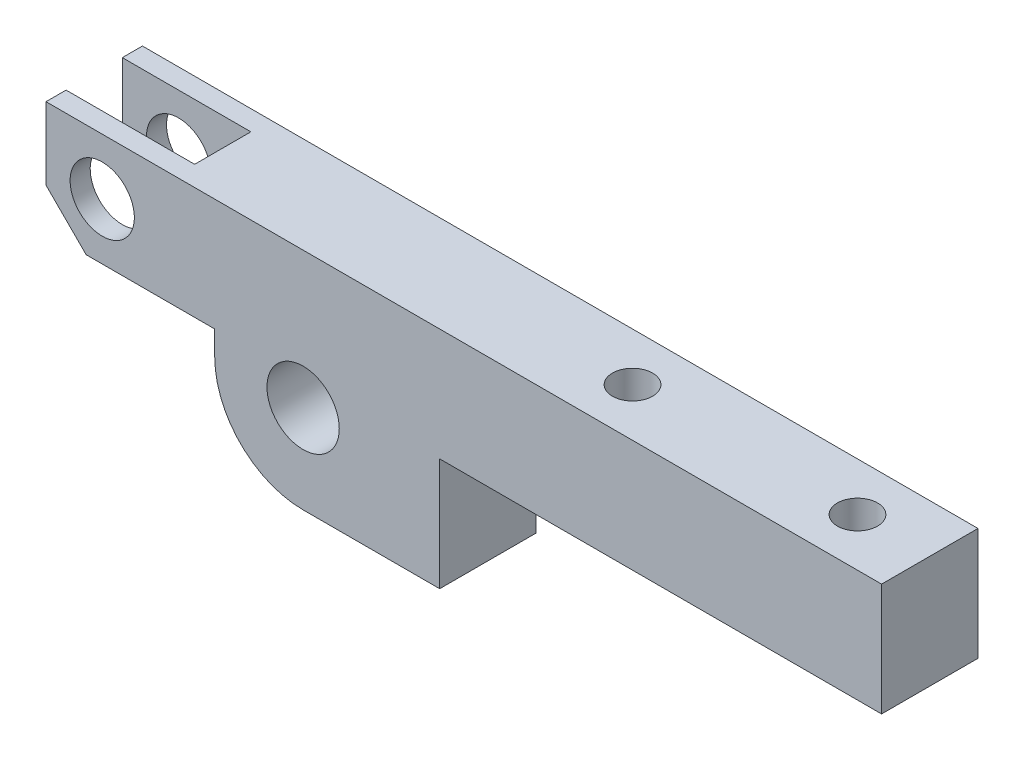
ISO-10303-21;
HEADER;
FILE_DESCRIPTION(('STEP AP214'),'2;1');
FILE_NAME('part.step','',(''),(''),'','','');
FILE_SCHEMA(('AUTOMOTIVE_DESIGN { 1 0 10303 214 1 1 1 1 }'));
ENDSEC;
DATA;
#1=APPLICATION_CONTEXT('core data for automotive mechanical design processes');
#2=APPLICATION_PROTOCOL_DEFINITION('international standard','automotive_design',2000,#1);
#3=PRODUCT_CONTEXT('',#1,'mechanical');
#4=PRODUCT('Part','Part','',(#3));
#5=PRODUCT_RELATED_PRODUCT_CATEGORY('part','',(#4));
#6=PRODUCT_DEFINITION_FORMATION('','',#4);
#7=PRODUCT_DEFINITION_CONTEXT('part definition',#1,'design');
#8=PRODUCT_DEFINITION('design','',#6,#7);
#9=PRODUCT_DEFINITION_SHAPE('','',#8);
#10=(LENGTH_UNIT() NAMED_UNIT(*) SI_UNIT(.MILLI.,.METRE.));
#11=(NAMED_UNIT(*) PLANE_ANGLE_UNIT() SI_UNIT($,.RADIAN.));
#12=(NAMED_UNIT(*) SI_UNIT($,.STERADIAN.) SOLID_ANGLE_UNIT());
#13=UNCERTAINTY_MEASURE_WITH_UNIT(LENGTH_MEASURE(1.E-05),#10,'distance_accuracy_value','');
#14=(GEOMETRIC_REPRESENTATION_CONTEXT(3) GLOBAL_UNCERTAINTY_ASSIGNED_CONTEXT((#13)) GLOBAL_UNIT_ASSIGNED_CONTEXT((#10,
#11,#12)) REPRESENTATION_CONTEXT('',''));
#15=CARTESIAN_POINT('',(0.,0.,0.));
#16=DIRECTION('',(0.,0.,1.));
#17=DIRECTION('',(1.,0.,0.));
#18=AXIS2_PLACEMENT_3D('',#15,#16,#17);
#19=CARTESIAN_POINT('',(-80.0000000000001,40.0000000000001,12.));
#20=DIRECTION('',(1.,0.,0.));
#21=DIRECTION('',(0.,0.,-1.));
#22=AXIS2_PLACEMENT_3D('',#19,#20,#21);
#23=PLANE('',#22);
#24=DIRECTION('',(0.,-1.,0.));
#25=VECTOR('',#24,1.);
#26=CARTESIAN_POINT('',(-80.0000000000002,40.0000000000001,0.));
#27=LINE('',#26,#25);
#28=CARTESIAN_POINT('',(-80.0000000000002,40.0000000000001,0.));
#29=VERTEX_POINT('',#28);
#30=CARTESIAN_POINT('',(-80.0000000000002,31.0000000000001,0.));
#31=VERTEX_POINT('',#30);
#32=EDGE_CURVE('E239',#29,#31,#27,.T.);
#33=ORIENTED_EDGE('',*,*,#32,.T.);
#34=DIRECTION('',(0.,0.,1.));
#35=VECTOR('',#34,1.);
#36=CARTESIAN_POINT('',(-80.0000000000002,31.0000000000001,12.));
#37=LINE('',#36,#35);
#38=CARTESIAN_POINT('',(-80.0000000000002,31.0000000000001,2.49999999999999));
#39=VERTEX_POINT('',#38);
#40=EDGE_CURVE('E166',#31,#39,#37,.T.);
#41=ORIENTED_EDGE('',*,*,#40,.T.);
#42=DIRECTION('',(0.,-1.,0.));
#43=VECTOR('',#42,1.);
#44=CARTESIAN_POINT('',(-80.0000000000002,40.0000000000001,2.49999999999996));
#45=LINE('',#44,#43);
#46=CARTESIAN_POINT('',(-80.0000000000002,40.0000000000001,2.49999999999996));
#47=VERTEX_POINT('',#46);
#48=EDGE_CURVE('E137',#47,#39,#45,.T.);
#49=ORIENTED_EDGE('',*,*,#48,.F.);
#50=DIRECTION('',(0.,0.,-1.));
#51=VECTOR('',#50,1.);
#52=CARTESIAN_POINT('',(-80.0000000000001,40.0000000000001,12.));
#53=LINE('',#52,#51);
#54=EDGE_CURVE('E153',#47,#29,#53,.T.);
#55=ORIENTED_EDGE('',*,*,#54,.T.);
#56=EDGE_LOOP('',(#33,#41,#49,#55));
#57=FACE_BOUND('',#56,.T.);
#58=ADVANCED_FACE('F24',(#57),#23,.F.);
#59=CARTESIAN_POINT('',(-48.,23.0000000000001,12.));
#60=DIRECTION('',(0.,0.,1.));
#61=DIRECTION('',(1.,0.,0.));
#62=AXIS2_PLACEMENT_3D('',#59,#60,#61);
#63=PLANE('',#62);
#64=CARTESIAN_POINT('',(-73.0000000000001,33.,12.));
#65=DIRECTION('',(0.,0.,1.));
#66=DIRECTION('',(1.,0.,0.));
#67=AXIS2_PLACEMENT_3D('',#64,#65,#66);
#68=CIRCLE('',#67,4.00000000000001);
#69=CARTESIAN_POINT('',(-69.0000000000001,33.,12.));
#70=VERTEX_POINT('',#69);
#71=EDGE_CURVE('E178',#70,#70,#68,.T.);
#72=ORIENTED_EDGE('',*,*,#71,.F.);
#73=EDGE_LOOP('',(#72));
#74=FACE_BOUND('',#73,.T.);
#75=DIRECTION('',(0.,-1.,0.));
#76=VECTOR('',#75,1.);
#77=CARTESIAN_POINT('',(-80.0000000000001,40.0000000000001,12.));
#78=LINE('',#77,#76);
#79=CARTESIAN_POINT('',(-80.0000000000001,40.0000000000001,12.));
#80=VERTEX_POINT('',#79);
#81=CARTESIAN_POINT('',(-80.0000000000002,31.0000000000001,12.));
#82=VERTEX_POINT('',#81);
#83=EDGE_CURVE('E151',#80,#82,#78,.T.);
#84=ORIENTED_EDGE('',*,*,#83,.T.);
#85=DIRECTION('',(-0.707106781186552,0.707106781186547,0.));
#86=VECTOR('',#85,1.);
#87=CARTESIAN_POINT('',(-59.9999999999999,11.0000000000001,12.));
#88=LINE('',#87,#86);
#89=CARTESIAN_POINT('',(-75.,26.0000000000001,12.));
#90=VERTEX_POINT('',#89);
#91=EDGE_CURVE('E11',#82,#90,#88,.F.);
#92=ORIENTED_EDGE('',*,*,#91,.T.);
#93=DIRECTION('',(1.,0.,0.));
#94=VECTOR('',#93,1.);
#95=CARTESIAN_POINT('',(-80.0000000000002,26.0000000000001,12.));
#96=LINE('',#95,#94);
#97=CARTESIAN_POINT('',(-59.0000000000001,26.0000000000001,12.));
#98=VERTEX_POINT('',#97);
#99=EDGE_CURVE('E262',#90,#98,#96,.T.);
#100=ORIENTED_EDGE('',*,*,#99,.T.);
#101=DIRECTION('',(0.,1.,0.));
#102=VECTOR('',#101,1.);
#103=CARTESIAN_POINT('',(-59.0000000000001,23.0000000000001,12.));
#104=LINE('',#103,#102);
#105=CARTESIAN_POINT('',(-59.0000000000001,23.0000000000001,12.));
#106=VERTEX_POINT('',#105);
#107=EDGE_CURVE('E259',#106,#98,#104,.T.);
#108=ORIENTED_EDGE('',*,*,#107,.F.);
#109=CARTESIAN_POINT('',(-48.,23.0000000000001,12.));
#110=DIRECTION('',(0.,0.,1.));
#111=DIRECTION('',(1.,0.,0.));
#112=AXIS2_PLACEMENT_3D('',#109,#110,#111);
#113=CIRCLE('',#112,11.);
#114=CARTESIAN_POINT('',(-48.0000000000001,12.,12.));
#115=VERTEX_POINT('',#114);
#116=EDGE_CURVE('E256',#106,#115,#113,.T.);
#117=ORIENTED_EDGE('',*,*,#116,.T.);
#118=DIRECTION('',(1.,0.,0.));
#119=VECTOR('',#118,1.);
#120=CARTESIAN_POINT('',(-48.0000000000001,12.,12.));
#121=LINE('',#120,#119);
#122=CARTESIAN_POINT('',(-31.,12.,12.));
#123=VERTEX_POINT('',#122);
#124=EDGE_CURVE('E253',#115,#123,#121,.T.);
#125=ORIENTED_EDGE('',*,*,#124,.T.);
#126=DIRECTION('',(0.,-1.,0.));
#127=VECTOR('',#126,1.);
#128=CARTESIAN_POINT('',(-31.0000000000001,26.0000000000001,12.));
#129=LINE('',#128,#127);
#130=CARTESIAN_POINT('',(-31.0000000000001,26.0000000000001,12.));
#131=VERTEX_POINT('',#130);
#132=EDGE_CURVE('E250',#131,#123,#129,.T.);
#133=ORIENTED_EDGE('',*,*,#132,.F.);
#134=DIRECTION('',(-1.,0.,0.));
#135=VECTOR('',#134,1.);
#136=CARTESIAN_POINT('',(24.0000000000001,26.0000000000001,12.));
#137=LINE('',#136,#135);
#138=CARTESIAN_POINT('',(24.0000000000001,26.0000000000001,12.));
#139=VERTEX_POINT('',#138);
#140=EDGE_CURVE('E247',#139,#131,#137,.T.);
#141=ORIENTED_EDGE('',*,*,#140,.F.);
#142=DIRECTION('',(0.,-1.,0.));
#143=VECTOR('',#142,1.);
#144=CARTESIAN_POINT('',(24.0000000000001,40.0000000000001,12.));
#145=LINE('',#144,#143);
#146=CARTESIAN_POINT('',(24.0000000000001,40.0000000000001,12.));
#147=VERTEX_POINT('',#146);
#148=EDGE_CURVE('E244',#147,#139,#145,.T.);
#149=ORIENTED_EDGE('',*,*,#148,.F.);
#150=DIRECTION('',(1.,0.,0.));
#151=VECTOR('',#150,1.);
#152=CARTESIAN_POINT('',(-80.0000000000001,40.0000000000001,12.));
#153=LINE('',#152,#151);
#154=EDGE_CURVE('E242',#80,#147,#153,.T.);
#155=ORIENTED_EDGE('',*,*,#154,.F.);
#156=EDGE_LOOP('',(#84,#92,#100,#108,#117,#125,#133,#141,#149,#155));
#157=FACE_BOUND('',#156,.T.);
#158=CARTESIAN_POINT('',(-48.,23.0000000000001,12.));
#159=DIRECTION('',(0.,0.,1.));
#160=DIRECTION('',(1.,0.,0.));
#161=AXIS2_PLACEMENT_3D('',#158,#159,#160);
#162=CIRCLE('',#161,4.5);
#163=CARTESIAN_POINT('',(-43.5,23.0000000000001,12.));
#164=VERTEX_POINT('',#163);
#165=EDGE_CURVE('E213',#164,#164,#162,.T.);
#166=ORIENTED_EDGE('',*,*,#165,.F.);
#167=EDGE_LOOP('',(#166));
#168=FACE_BOUND('',#167,.T.);
#169=ADVANCED_FACE('F297',(#74,#157,#168),#63,.T.);
#170=CARTESIAN_POINT('',(-48.0000000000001,23.0000000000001,0.));
#171=DIRECTION('',(0.,0.,1.));
#172=DIRECTION('',(1.,0.,0.));
#173=AXIS2_PLACEMENT_3D('',#170,#171,#172);
#174=PLANE('',#173);
#175=CARTESIAN_POINT('',(-73.0000000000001,33.,0.));
#176=DIRECTION('',(0.,0.,1.));
#177=DIRECTION('',(1.,0.,0.));
#178=AXIS2_PLACEMENT_3D('',#175,#176,#177);
#179=CIRCLE('',#178,4.00000000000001);
#180=CARTESIAN_POINT('',(-69.0000000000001,33.,0.));
#181=VERTEX_POINT('',#180);
#182=EDGE_CURVE('E175',#181,#181,#179,.T.);
#183=ORIENTED_EDGE('',*,*,#182,.T.);
#184=EDGE_LOOP('',(#183));
#185=FACE_BOUND('',#184,.T.);
#186=DIRECTION('',(1.,0.,0.));
#187=VECTOR('',#186,1.);
#188=CARTESIAN_POINT('',(-80.0000000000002,26.0000000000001,0.));
#189=LINE('',#188,#187);
#190=CARTESIAN_POINT('',(-75.,26.0000000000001,0.));
#191=VERTEX_POINT('',#190);
#192=CARTESIAN_POINT('',(-59.,26.0000000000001,0.));
#193=VERTEX_POINT('',#192);
#194=EDGE_CURVE('E237',#191,#193,#189,.T.);
#195=ORIENTED_EDGE('',*,*,#194,.F.);
#196=DIRECTION('',(0.707106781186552,-0.707106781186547,0.));
#197=VECTOR('',#196,1.);
#198=CARTESIAN_POINT('',(-75.,26.0000000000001,0.));
#199=LINE('',#198,#197);
#200=EDGE_CURVE('E164',#191,#31,#199,.F.);
#201=ORIENTED_EDGE('',*,*,#200,.T.);
#202=ORIENTED_EDGE('',*,*,#32,.F.);
#203=DIRECTION('',(1.,0.,0.));
#204=VECTOR('',#203,1.);
#205=CARTESIAN_POINT('',(-80.0000000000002,40.0000000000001,0.));
#206=LINE('',#205,#204);
#207=CARTESIAN_POINT('',(24.,40.0000000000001,0.));
#208=VERTEX_POINT('',#207);
#209=EDGE_CURVE('E216',#29,#208,#206,.T.);
#210=ORIENTED_EDGE('',*,*,#209,.T.);
#211=DIRECTION('',(0.,-1.,0.));
#212=VECTOR('',#211,1.);
#213=CARTESIAN_POINT('',(24.,40.0000000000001,0.));
#214=LINE('',#213,#212);
#215=CARTESIAN_POINT('',(24.0000000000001,26.0000000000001,0.));
#216=VERTEX_POINT('',#215);
#217=EDGE_CURVE('E219',#208,#216,#214,.T.);
#218=ORIENTED_EDGE('',*,*,#217,.T.);
#219=DIRECTION('',(-1.,0.,0.));
#220=VECTOR('',#219,1.);
#221=CARTESIAN_POINT('',(24.0000000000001,26.0000000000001,0.));
#222=LINE('',#221,#220);
#223=CARTESIAN_POINT('',(-31.,26.0000000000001,0.));
#224=VERTEX_POINT('',#223);
#225=EDGE_CURVE('E222',#216,#224,#222,.T.);
#226=ORIENTED_EDGE('',*,*,#225,.T.);
#227=DIRECTION('',(0.,-1.,0.));
#228=VECTOR('',#227,1.);
#229=CARTESIAN_POINT('',(-31.,26.0000000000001,0.));
#230=LINE('',#229,#228);
#231=CARTESIAN_POINT('',(-31.,12.,0.));
#232=VERTEX_POINT('',#231);
#233=EDGE_CURVE('E225',#224,#232,#230,.T.);
#234=ORIENTED_EDGE('',*,*,#233,.T.);
#235=DIRECTION('',(1.,0.,0.));
#236=VECTOR('',#235,1.);
#237=CARTESIAN_POINT('',(-48.0000000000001,12.,0.));
#238=LINE('',#237,#236);
#239=CARTESIAN_POINT('',(-48.0000000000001,12.,0.));
#240=VERTEX_POINT('',#239);
#241=EDGE_CURVE('E228',#240,#232,#238,.T.);
#242=ORIENTED_EDGE('',*,*,#241,.F.);
#243=CARTESIAN_POINT('',(-48.0000000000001,23.0000000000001,0.));
#244=DIRECTION('',(0.,0.,1.));
#245=DIRECTION('',(1.,0.,0.));
#246=AXIS2_PLACEMENT_3D('',#243,#244,#245);
#247=CIRCLE('',#246,11.);
#248=CARTESIAN_POINT('',(-59.0000000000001,23.,0.));
#249=VERTEX_POINT('',#248);
#250=EDGE_CURVE('E231',#249,#240,#247,.T.);
#251=ORIENTED_EDGE('',*,*,#250,.F.);
#252=DIRECTION('',(0.,1.,0.));
#253=VECTOR('',#252,1.);
#254=CARTESIAN_POINT('',(-59.0000000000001,23.,0.));
#255=LINE('',#254,#253);
#256=EDGE_CURVE('E234',#249,#193,#255,.T.);
#257=ORIENTED_EDGE('',*,*,#256,.T.);
#258=EDGE_LOOP('',(#195,#201,#202,#210,#218,#226,#234,#242,#251,#257));
#259=FACE_BOUND('',#258,.T.);
#260=CARTESIAN_POINT('',(-48.0000000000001,23.0000000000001,0.));
#261=DIRECTION('',(0.,0.,1.));
#262=DIRECTION('',(1.,0.,0.));
#263=AXIS2_PLACEMENT_3D('',#260,#261,#262);
#264=CIRCLE('',#263,4.5);
#265=CARTESIAN_POINT('',(-43.5,23.0000000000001,0.));
#266=VERTEX_POINT('',#265);
#267=EDGE_CURVE('E210',#266,#266,#264,.T.);
#268=ORIENTED_EDGE('',*,*,#267,.T.);
#269=EDGE_LOOP('',(#268));
#270=FACE_BOUND('',#269,.T.);
#271=ADVANCED_FACE('F288',(#185,#259,#270),#174,.F.);
#272=CARTESIAN_POINT('',(-80.0000000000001,40.0000000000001,12.));
#273=DIRECTION('',(0.,1.,0.));
#274=DIRECTION('',(0.,0.,1.));
#275=AXIS2_PLACEMENT_3D('',#272,#273,#274);
#276=PLANE('',#275);
#277=CARTESIAN_POINT('',(-13.,40.0000000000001,6.00000000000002));
#278=DIRECTION('',(0.,1.,0.));
#279=DIRECTION('',(-1.,0.,0.));
#280=AXIS2_PLACEMENT_3D('',#277,#278,#279);
#281=CIRCLE('',#280,2.5);
#282=CARTESIAN_POINT('',(-15.5,40.0000000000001,6.00000000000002));
#283=VERTEX_POINT('',#282);
#284=EDGE_CURVE('E189',#283,#283,#281,.T.);
#285=ORIENTED_EDGE('',*,*,#284,.F.);
#286=EDGE_LOOP('',(#285));
#287=FACE_BOUND('',#286,.T.);
#288=CARTESIAN_POINT('',(15.,40.0000000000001,5.99999999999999));
#289=DIRECTION('',(0.,1.,0.));
#290=DIRECTION('',(-1.,0.,0.));
#291=AXIS2_PLACEMENT_3D('',#288,#289,#290);
#292=CIRCLE('',#291,2.5);
#293=CARTESIAN_POINT('',(12.5,40.0000000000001,5.99999999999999));
#294=VERTEX_POINT('',#293);
#295=EDGE_CURVE('E179',#294,#294,#292,.T.);
#296=ORIENTED_EDGE('',*,*,#295,.F.);
#297=EDGE_LOOP('',(#296));
#298=FACE_BOUND('',#297,.T.);
#299=DIRECTION('',(-1.,0.,0.));
#300=VECTOR('',#299,1.);
#301=CARTESIAN_POINT('',(-64.,40.0000000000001,2.5));
#302=LINE('',#301,#300);
#303=CARTESIAN_POINT('',(-64.,40.0000000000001,2.5));
#304=VERTEX_POINT('',#303);
#305=EDGE_CURVE('E148',#304,#47,#302,.T.);
#306=ORIENTED_EDGE('',*,*,#305,.F.);
#307=DIRECTION('',(0.,0.,1.));
#308=VECTOR('',#307,1.);
#309=CARTESIAN_POINT('',(-64.,40.0000000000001,2.5));
#310=LINE('',#309,#308);
#311=CARTESIAN_POINT('',(-64.,40.0000000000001,9.5));
#312=VERTEX_POINT('',#311);
#313=EDGE_CURVE('E147',#304,#312,#310,.T.);
#314=ORIENTED_EDGE('',*,*,#313,.T.);
#315=DIRECTION('',(-1.,0.,0.));
#316=VECTOR('',#315,1.);
#317=CARTESIAN_POINT('',(-64.,40.0000000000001,9.5));
#318=LINE('',#317,#316);
#319=CARTESIAN_POINT('',(-80.0000000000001,40.0000000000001,9.49999999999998));
#320=VERTEX_POINT('',#319);
#321=EDGE_CURVE('E133',#312,#320,#318,.T.);
#322=ORIENTED_EDGE('',*,*,#321,.T.);
#323=EDGE_CURVE('E144',#80,#320,#53,.T.);
#324=ORIENTED_EDGE('',*,*,#323,.F.);
#325=ORIENTED_EDGE('',*,*,#154,.T.);
#326=DIRECTION('',(0.,0.,-1.));
#327=VECTOR('',#326,1.);
#328=CARTESIAN_POINT('',(24.0000000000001,40.0000000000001,12.));
#329=LINE('',#328,#327);
#330=EDGE_CURVE('E265',#147,#208,#329,.T.);
#331=ORIENTED_EDGE('',*,*,#330,.T.);
#332=ORIENTED_EDGE('',*,*,#209,.F.);
#333=ORIENTED_EDGE('',*,*,#54,.F.);
#334=EDGE_LOOP('',(#306,#314,#322,#324,#325,#331,#332,#333));
#335=FACE_BOUND('',#334,.T.);
#336=ADVANCED_FACE('F142',(#287,#298,#335),#276,.T.);
#337=DIRECTION('',(0.,1.,0.));
#338=VECTOR('',#337,1.);
#339=CARTESIAN_POINT('',(-80.0000000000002,26.0000000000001,9.49999999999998));
#340=LINE('',#339,#338);
#341=CARTESIAN_POINT('',(-80.0000000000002,31.0000000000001,9.5));
#342=VERTEX_POINT('',#341);
#343=EDGE_CURVE('E129',#342,#320,#340,.T.);
#344=ORIENTED_EDGE('',*,*,#343,.F.);
#345=DIRECTION('',(0.,0.,1.));
#346=VECTOR('',#345,1.);
#347=CARTESIAN_POINT('',(-80.0000000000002,31.0000000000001,12.));
#348=LINE('',#347,#346);
#349=EDGE_CURVE('E33',#342,#82,#348,.T.);
#350=ORIENTED_EDGE('',*,*,#349,.T.);
#351=ORIENTED_EDGE('',*,*,#83,.F.);
#352=ORIENTED_EDGE('',*,*,#323,.T.);
#353=EDGE_LOOP('',(#344,#350,#351,#352));
#354=FACE_BOUND('',#353,.T.);
#355=ADVANCED_FACE('F26',(#354),#23,.F.);
#356=CARTESIAN_POINT('',(-80.0000000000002,26.0000000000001,12.));
#357=DIRECTION('',(0.,1.,0.));
#358=DIRECTION('',(-1.,0.,0.));
#359=AXIS2_PLACEMENT_3D('',#356,#357,#358);
#360=PLANE('',#359);
#361=DIRECTION('',(-1.,0.,0.));
#362=VECTOR('',#361,1.);
#363=CARTESIAN_POINT('',(-64.,26.,2.5));
#364=LINE('',#363,#362);
#365=CARTESIAN_POINT('',(-64.,26.,2.5));
#366=VERTEX_POINT('',#365);
#367=CARTESIAN_POINT('',(-75.,26.0000000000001,2.49999999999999));
#368=VERTEX_POINT('',#367);
#369=EDGE_CURVE('E205',#366,#368,#364,.T.);
#370=ORIENTED_EDGE('',*,*,#369,.T.);
#371=DIRECTION('',(0.,0.,-1.));
#372=VECTOR('',#371,1.);
#373=CARTESIAN_POINT('',(-75.,26.0000000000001,12.));
#374=LINE('',#373,#372);
#375=EDGE_CURVE('E156',#368,#191,#374,.T.);
#376=ORIENTED_EDGE('',*,*,#375,.T.);
#377=ORIENTED_EDGE('',*,*,#194,.T.);
#378=DIRECTION('',(0.,0.,-1.));
#379=VECTOR('',#378,1.);
#380=CARTESIAN_POINT('',(-59.0000000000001,26.0000000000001,12.));
#381=LINE('',#380,#379);
#382=EDGE_CURVE('E158',#98,#193,#381,.T.);
#383=ORIENTED_EDGE('',*,*,#382,.F.);
#384=ORIENTED_EDGE('',*,*,#99,.F.);
#385=DIRECTION('',(0.,0.,-1.));
#386=VECTOR('',#385,1.);
#387=CARTESIAN_POINT('',(-75.,26.0000000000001,12.));
#388=LINE('',#387,#386);
#389=CARTESIAN_POINT('',(-75.,26.0000000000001,9.49999999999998));
#390=VERTEX_POINT('',#389);
#391=EDGE_CURVE('E152',#90,#390,#388,.T.);
#392=ORIENTED_EDGE('',*,*,#391,.T.);
#393=DIRECTION('',(-1.,0.,0.));
#394=VECTOR('',#393,1.);
#395=CARTESIAN_POINT('',(-64.,26.,9.5));
#396=LINE('',#395,#394);
#397=CARTESIAN_POINT('',(-64.,26.,9.5));
#398=VERTEX_POINT('',#397);
#399=EDGE_CURVE('E149',#398,#390,#396,.T.);
#400=ORIENTED_EDGE('',*,*,#399,.F.);
#401=DIRECTION('',(0.,0.,-1.));
#402=VECTOR('',#401,1.);
#403=CARTESIAN_POINT('',(-64.,26.,9.5));
#404=LINE('',#403,#402);
#405=EDGE_CURVE('E199',#398,#366,#404,.T.);
#406=ORIENTED_EDGE('',*,*,#405,.T.);
#407=EDGE_LOOP('',(#370,#376,#377,#383,#384,#392,#400,#406));
#408=FACE_BOUND('',#407,.T.);
#409=ADVANCED_FACE('F301',(#408),#360,.F.);
#410=CARTESIAN_POINT('',(-59.0000000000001,23.0000000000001,12.));
#411=DIRECTION('',(-1.,0.,0.));
#412=DIRECTION('',(0.,-1.,0.));
#413=AXIS2_PLACEMENT_3D('',#410,#411,#412);
#414=PLANE('',#413);
#415=DIRECTION('',(0.,0.,-1.));
#416=VECTOR('',#415,1.);
#417=CARTESIAN_POINT('',(-59.0000000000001,23.0000000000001,12.));
#418=LINE('',#417,#416);
#419=EDGE_CURVE('E274',#106,#249,#418,.T.);
#420=ORIENTED_EDGE('',*,*,#419,.F.);
#421=ORIENTED_EDGE('',*,*,#107,.T.);
#422=ORIENTED_EDGE('',*,*,#382,.T.);
#423=ORIENTED_EDGE('',*,*,#256,.F.);
#424=EDGE_LOOP('',(#420,#421,#422,#423));
#425=FACE_BOUND('',#424,.T.);
#426=ADVANCED_FACE('F282',(#425),#414,.T.);
#427=CARTESIAN_POINT('',(-48.,23.0000000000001,12.));
#428=DIRECTION('',(0.,0.,-1.));
#429=DIRECTION('',(-1.,0.,0.));
#430=AXIS2_PLACEMENT_3D('',#427,#428,#429);
#431=CYLINDRICAL_SURFACE('',#430,11.);
#432=DIRECTION('',(0.,0.,-1.));
#433=VECTOR('',#432,1.);
#434=CARTESIAN_POINT('',(-48.0000000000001,12.,12.));
#435=LINE('',#434,#433);
#436=EDGE_CURVE('E273',#115,#240,#435,.T.);
#437=ORIENTED_EDGE('',*,*,#436,.F.);
#438=ORIENTED_EDGE('',*,*,#116,.F.);
#439=ORIENTED_EDGE('',*,*,#419,.T.);
#440=ORIENTED_EDGE('',*,*,#250,.T.);
#441=EDGE_LOOP('',(#437,#438,#439,#440));
#442=FACE_BOUND('',#441,.T.);
#443=ADVANCED_FACE('F291',(#442),#431,.T.);
#444=CARTESIAN_POINT('',(-48.0000000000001,12.,12.));
#445=DIRECTION('',(0.,1.,0.));
#446=DIRECTION('',(0.,0.,1.));
#447=AXIS2_PLACEMENT_3D('',#444,#445,#446);
#448=PLANE('',#447);
#449=DIRECTION('',(0.,0.,-1.));
#450=VECTOR('',#449,1.);
#451=CARTESIAN_POINT('',(-31.,12.,12.));
#452=LINE('',#451,#450);
#453=EDGE_CURVE('E271',#123,#232,#452,.T.);
#454=ORIENTED_EDGE('',*,*,#453,.F.);
#455=ORIENTED_EDGE('',*,*,#124,.F.);
#456=ORIENTED_EDGE('',*,*,#436,.T.);
#457=ORIENTED_EDGE('',*,*,#241,.T.);
#458=EDGE_LOOP('',(#454,#455,#456,#457));
#459=FACE_BOUND('',#458,.T.);
#460=ADVANCED_FACE('F294',(#459),#448,.F.);
#461=CARTESIAN_POINT('',(-31.0000000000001,26.0000000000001,12.));
#462=DIRECTION('',(1.,0.,0.));
#463=DIRECTION('',(0.,0.,-1.));
#464=AXIS2_PLACEMENT_3D('',#461,#462,#463);
#465=PLANE('',#464);
#466=DIRECTION('',(0.,0.,-1.));
#467=VECTOR('',#466,1.);
#468=CARTESIAN_POINT('',(-31.0000000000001,26.0000000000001,12.));
#469=LINE('',#468,#467);
#470=EDGE_CURVE('E269',#131,#224,#469,.T.);
#471=ORIENTED_EDGE('',*,*,#470,.F.);
#472=ORIENTED_EDGE('',*,*,#132,.T.);
#473=ORIENTED_EDGE('',*,*,#453,.T.);
#474=ORIENTED_EDGE('',*,*,#233,.F.);
#475=EDGE_LOOP('',(#471,#472,#473,#474));
#476=FACE_BOUND('',#475,.T.);
#477=ADVANCED_FACE('F349',(#476),#465,.T.);
#478=CARTESIAN_POINT('',(24.0000000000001,26.0000000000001,12.));
#479=DIRECTION('',(0.,-1.,0.));
#480=DIRECTION('',(1.,0.,0.));
#481=AXIS2_PLACEMENT_3D('',#478,#479,#480);
#482=PLANE('',#481);
#483=CARTESIAN_POINT('',(-13.,26.0000000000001,6.));
#484=DIRECTION('',(0.,-1.,0.));
#485=DIRECTION('',(1.,0.,0.));
#486=AXIS2_PLACEMENT_3D('',#483,#484,#485);
#487=CIRCLE('',#486,2.5);
#488=CARTESIAN_POINT('',(-10.5,26.0000000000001,6.));
#489=VERTEX_POINT('',#488);
#490=EDGE_CURVE('E28',#489,#489,#487,.T.);
#491=ORIENTED_EDGE('',*,*,#490,.F.);
#492=EDGE_LOOP('',(#491));
#493=FACE_BOUND('',#492,.T.);
#494=CARTESIAN_POINT('',(15.,26.0000000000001,6.));
#495=DIRECTION('',(0.,-1.,0.));
#496=DIRECTION('',(1.,0.,0.));
#497=AXIS2_PLACEMENT_3D('',#494,#495,#496);
#498=CIRCLE('',#497,2.5);
#499=CARTESIAN_POINT('',(17.5,26.0000000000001,6.));
#500=VERTEX_POINT('',#499);
#501=EDGE_CURVE('E176',#500,#500,#498,.T.);
#502=ORIENTED_EDGE('',*,*,#501,.F.);
#503=EDGE_LOOP('',(#502));
#504=FACE_BOUND('',#503,.T.);
#505=DIRECTION('',(0.,0.,-1.));
#506=VECTOR('',#505,1.);
#507=CARTESIAN_POINT('',(24.0000000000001,26.0000000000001,12.));
#508=LINE('',#507,#506);
#509=EDGE_CURVE('E267',#139,#216,#508,.T.);
#510=ORIENTED_EDGE('',*,*,#509,.F.);
#511=ORIENTED_EDGE('',*,*,#140,.T.);
#512=ORIENTED_EDGE('',*,*,#470,.T.);
#513=ORIENTED_EDGE('',*,*,#225,.F.);
#514=EDGE_LOOP('',(#510,#511,#512,#513));
#515=FACE_BOUND('',#514,.T.);
#516=ADVANCED_FACE('F345',(#493,#504,#515),#482,.T.);
#517=CARTESIAN_POINT('',(24.0000000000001,40.0000000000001,12.));
#518=DIRECTION('',(1.,0.,0.));
#519=DIRECTION('',(0.,1.,0.));
#520=AXIS2_PLACEMENT_3D('',#517,#518,#519);
#521=PLANE('',#520);
#522=ORIENTED_EDGE('',*,*,#148,.T.);
#523=ORIENTED_EDGE('',*,*,#509,.T.);
#524=ORIENTED_EDGE('',*,*,#217,.F.);
#525=ORIENTED_EDGE('',*,*,#330,.F.);
#526=EDGE_LOOP('',(#522,#523,#524,#525));
#527=FACE_BOUND('',#526,.T.);
#528=ADVANCED_FACE('F341',(#527),#521,.T.);
#529=CARTESIAN_POINT('',(-48.,23.0000000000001,12.));
#530=DIRECTION('',(0.,0.,-1.));
#531=DIRECTION('',(-1.,0.,0.));
#532=AXIS2_PLACEMENT_3D('',#529,#530,#531);
#533=CYLINDRICAL_SURFACE('',#532,4.5);
#534=ORIENTED_EDGE('',*,*,#165,.T.);
#535=EDGE_LOOP('',(#534));
#536=FACE_BOUND('',#535,.T.);
#537=ORIENTED_EDGE('',*,*,#267,.F.);
#538=EDGE_LOOP('',(#537));
#539=FACE_BOUND('',#538,.T.);
#540=ADVANCED_FACE('F344',(#536,#539),#533,.F.);
#541=CARTESIAN_POINT('',(-64.,40.0000000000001,2.5));
#542=DIRECTION('',(0.,0.,-1.));
#543=DIRECTION('',(0.,1.,0.));
#544=AXIS2_PLACEMENT_3D('',#541,#542,#543);
#545=PLANE('',#544);
#546=CARTESIAN_POINT('',(-73.0000000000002,33.,2.5));
#547=DIRECTION('',(0.,0.,-1.));
#548=DIRECTION('',(0.,1.,0.));
#549=AXIS2_PLACEMENT_3D('',#546,#547,#548);
#550=CIRCLE('',#549,4.00000000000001);
#551=CARTESIAN_POINT('',(-73.0000000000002,37.0000000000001,2.5));
#552=VERTEX_POINT('',#551);
#553=EDGE_CURVE('E174',#552,#552,#550,.T.);
#554=ORIENTED_EDGE('',*,*,#553,.T.);
#555=EDGE_LOOP('',(#554));
#556=FACE_BOUND('',#555,.T.);
#557=ORIENTED_EDGE('',*,*,#48,.T.);
#558=DIRECTION('',(-0.707106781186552,0.707106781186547,0.));
#559=VECTOR('',#558,1.);
#560=CARTESIAN_POINT('',(-75.,26.0000000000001,2.49999999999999));
#561=LINE('',#560,#559);
#562=EDGE_CURVE('E168',#39,#368,#561,.F.);
#563=ORIENTED_EDGE('',*,*,#562,.T.);
#564=ORIENTED_EDGE('',*,*,#369,.F.);
#565=DIRECTION('',(0.,-1.,0.));
#566=VECTOR('',#565,1.);
#567=CARTESIAN_POINT('',(-64.,40.0000000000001,2.5));
#568=LINE('',#567,#566);
#569=EDGE_CURVE('E136',#304,#366,#568,.T.);
#570=ORIENTED_EDGE('',*,*,#569,.F.);
#571=ORIENTED_EDGE('',*,*,#305,.T.);
#572=EDGE_LOOP('',(#557,#563,#564,#570,#571));
#573=FACE_BOUND('',#572,.T.);
#574=ADVANCED_FACE('F389',(#556,#573),#545,.F.);
#575=CARTESIAN_POINT('',(-64.,26.,9.5));
#576=DIRECTION('',(0.,0.,1.));
#577=DIRECTION('',(1.,0.,0.));
#578=AXIS2_PLACEMENT_3D('',#575,#576,#577);
#579=PLANE('',#578);
#580=CARTESIAN_POINT('',(-73.0000000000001,33.,9.5));
#581=DIRECTION('',(0.,0.,1.));
#582=DIRECTION('',(0.,-1.,0.));
#583=AXIS2_PLACEMENT_3D('',#580,#581,#582);
#584=CIRCLE('',#583,4.00000000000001);
#585=CARTESIAN_POINT('',(-73.0000000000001,29.,9.5));
#586=VERTEX_POINT('',#585);
#587=EDGE_CURVE('E172',#586,#586,#584,.T.);
#588=ORIENTED_EDGE('',*,*,#587,.T.);
#589=EDGE_LOOP('',(#588));
#590=FACE_BOUND('',#589,.T.);
#591=ORIENTED_EDGE('',*,*,#399,.T.);
#592=DIRECTION('',(0.707106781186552,-0.707106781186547,0.));
#593=VECTOR('',#592,1.);
#594=CARTESIAN_POINT('',(-75.,26.0000000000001,9.49999999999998));
#595=LINE('',#594,#593);
#596=EDGE_CURVE('E48',#390,#342,#595,.F.);
#597=ORIENTED_EDGE('',*,*,#596,.T.);
#598=ORIENTED_EDGE('',*,*,#343,.T.);
#599=ORIENTED_EDGE('',*,*,#321,.F.);
#600=DIRECTION('',(0.,1.,0.));
#601=VECTOR('',#600,1.);
#602=CARTESIAN_POINT('',(-64.,26.,9.5));
#603=LINE('',#602,#601);
#604=EDGE_CURVE('E202',#398,#312,#603,.T.);
#605=ORIENTED_EDGE('',*,*,#604,.F.);
#606=EDGE_LOOP('',(#591,#597,#598,#599,#605));
#607=FACE_BOUND('',#606,.T.);
#608=ADVANCED_FACE('F131',(#590,#607),#579,.F.);
#609=CARTESIAN_POINT('',(-64.,26.,2.5));
#610=DIRECTION('',(1.,0.,0.));
#611=DIRECTION('',(0.,0.,-1.));
#612=AXIS2_PLACEMENT_3D('',#609,#610,#611);
#613=PLANE('',#612);
#614=ORIENTED_EDGE('',*,*,#569,.T.);
#615=ORIENTED_EDGE('',*,*,#405,.F.);
#616=ORIENTED_EDGE('',*,*,#604,.T.);
#617=ORIENTED_EDGE('',*,*,#313,.F.);
#618=EDGE_LOOP('',(#614,#615,#616,#617));
#619=FACE_BOUND('',#618,.T.);
#620=ADVANCED_FACE('F316',(#619),#613,.F.);
#621=CARTESIAN_POINT('',(-75.,26.0000000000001,12.));
#622=DIRECTION('',(0.707106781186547,0.707106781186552,0.));
#623=DIRECTION('',(-0.707106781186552,0.707106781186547,0.));
#624=AXIS2_PLACEMENT_3D('',#621,#622,#623);
#625=PLANE('',#624);
#626=ORIENTED_EDGE('',*,*,#562,.F.);
#627=ORIENTED_EDGE('',*,*,#40,.F.);
#628=ORIENTED_EDGE('',*,*,#200,.F.);
#629=ORIENTED_EDGE('',*,*,#375,.F.);
#630=EDGE_LOOP('',(#626,#627,#628,#629));
#631=FACE_BOUND('',#630,.T.);
#632=ADVANCED_FACE('F307',(#631),#625,.F.);
#633=CARTESIAN_POINT('',(-75.,26.0000000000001,12.));
#634=DIRECTION('',(0.707106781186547,0.707106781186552,0.));
#635=DIRECTION('',(-0.707106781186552,0.707106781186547,0.));
#636=AXIS2_PLACEMENT_3D('',#633,#634,#635);
#637=PLANE('',#636);
#638=ORIENTED_EDGE('',*,*,#91,.F.);
#639=ORIENTED_EDGE('',*,*,#349,.F.);
#640=ORIENTED_EDGE('',*,*,#596,.F.);
#641=ORIENTED_EDGE('',*,*,#391,.F.);
#642=EDGE_LOOP('',(#638,#639,#640,#641));
#643=FACE_BOUND('',#642,.T.);
#644=ADVANCED_FACE('F304',(#643),#637,.F.);
#645=CARTESIAN_POINT('',(-73.0000000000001,33.,0.));
#646=DIRECTION('',(0.,0.,1.));
#647=DIRECTION('',(1.,0.,0.));
#648=AXIS2_PLACEMENT_3D('',#645,#646,#647);
#649=CYLINDRICAL_SURFACE('',#648,4.00000000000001);
#650=ORIENTED_EDGE('',*,*,#71,.T.);
#651=EDGE_LOOP('',(#650));
#652=FACE_BOUND('',#651,.T.);
#653=ORIENTED_EDGE('',*,*,#587,.F.);
#654=EDGE_LOOP('',(#653));
#655=FACE_BOUND('',#654,.T.);
#656=ADVANCED_FACE('F306',(#652,#655),#649,.F.);
#657=ORIENTED_EDGE('',*,*,#182,.F.);
#658=EDGE_LOOP('',(#657));
#659=FACE_BOUND('',#658,.T.);
#660=ORIENTED_EDGE('',*,*,#553,.F.);
#661=EDGE_LOOP('',(#660));
#662=FACE_BOUND('',#661,.T.);
#663=ADVANCED_FACE('F313',(#659,#662),#649,.F.);
#664=CARTESIAN_POINT('',(15.,25.0000000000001,6.));
#665=DIRECTION('',(0.,1.,0.));
#666=DIRECTION('',(-1.,0.,0.));
#667=AXIS2_PLACEMENT_3D('',#664,#665,#666);
#668=CYLINDRICAL_SURFACE('',#667,2.5);
#669=ORIENTED_EDGE('',*,*,#501,.T.);
#670=EDGE_LOOP('',(#669));
#671=FACE_BOUND('',#670,.T.);
#672=ORIENTED_EDGE('',*,*,#295,.T.);
#673=EDGE_LOOP('',(#672));
#674=FACE_BOUND('',#673,.T.);
#675=ADVANCED_FACE('F429',(#671,#674),#668,.F.);
#676=CARTESIAN_POINT('',(-13.,25.0000000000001,6.00000000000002));
#677=DIRECTION('',(0.,1.,0.));
#678=DIRECTION('',(-1.,0.,0.));
#679=AXIS2_PLACEMENT_3D('',#676,#677,#678);
#680=CYLINDRICAL_SURFACE('',#679,2.5);
#681=ORIENTED_EDGE('',*,*,#490,.T.);
#682=EDGE_LOOP('',(#681));
#683=FACE_BOUND('',#682,.T.);
#684=ORIENTED_EDGE('',*,*,#284,.T.);
#685=EDGE_LOOP('',(#684));
#686=FACE_BOUND('',#685,.T.);
#687=ADVANCED_FACE('F436',(#683,#686),#680,.F.);
#688=CLOSED_SHELL('',(#58,#169,#271,#336,#355,#409,#426,#443,#460,#477,#516,#528,#540,#574,#608,
#620,#632,#644,#656,#663,#675,#687));
#689=MANIFOLD_SOLID_BREP('B2',#688);
#690=ADVANCED_BREP_SHAPE_REPRESENTATION('',(#18,#689),#14);
#691=SHAPE_DEFINITION_REPRESENTATION(#9,#690);
ENDSEC;
END-ISO-10303-21;
